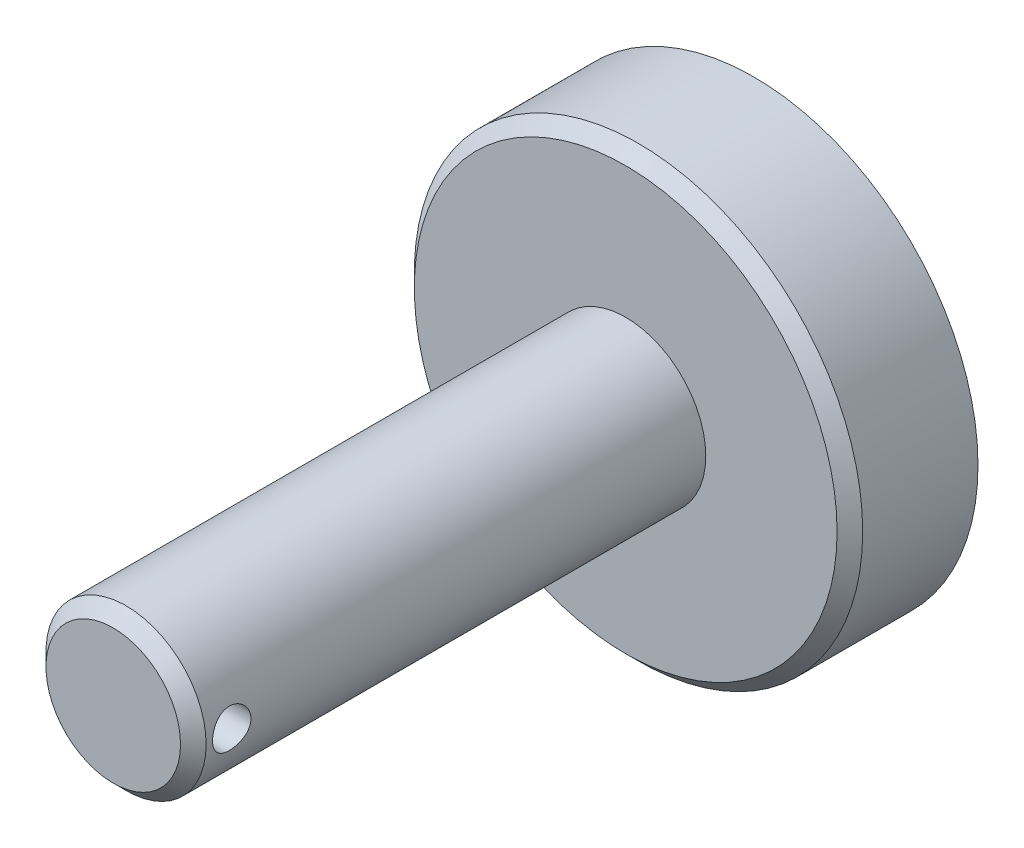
from build123d import *

# Parameters (mm, degrees)
ESQUISSE1_R             = 35
BASE_EXTRUSION_DEPTH    = 20
ESQUISSE2_R             = 12.5
BOSS_EXTRU_1_DEPTH      = 80
CHANFREIN1_SIZE         = 2
ESQUISSE3_R             = 3
ENL_V_MAT_EXTRU_1_DEPTH = 15


with BuildPart() as part:
    # Esquisse1 → Base-Extrusion (new body)
    with BuildSketch(Plane.XY):
        Circle(ESQUISSE1_R)
    extrude(amount=BASE_EXTRUSION_DEPTH)

    # Esquisse2 → Boss.-Extru.1 (add)
    with BuildSketch(Plane.XY.offset(20)):
        Circle(ESQUISSE2_R)
    extrude(amount=BOSS_EXTRU_1_DEPTH)

    # Chanfrein1
    chanfrein1_edges = [part.edges().sort_by_distance(p)[0] for p in [
        (-35, 0, 20),
        (-12.5, 0, 100),
    ]]
    chamfer(chanfrein1_edges, length=CHANFREIN1_SIZE)

    # Esquisse3 → Enl_v. mat.-Extru.1 (cut, symmetric)
    with BuildSketch(Plane(origin=(0, 0, 0), x_dir=(0, 0, -1), z_dir=(1, 0, 0))):
        with Locations(Location((-94, 0, 0), (0, 0, 180))):
            Circle(ESQUISSE3_R)
    extrude(amount=ENL_V_MAT_EXTRU_1_DEPTH, both=True, mode=Mode.SUBTRACT)


solid = part.part
